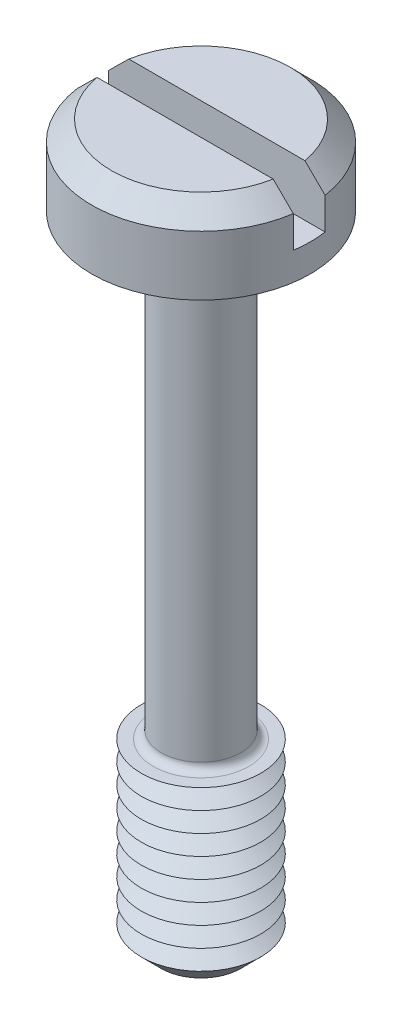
from build123d import *

# Parameters (mm, degrees)
SKETCH1_R           = 2.75
BOSS_EXTRUDE1_DEPTH = 2
SKETCH2_R           = 1
BOSS_EXTRUDE2_DEPTH = 16
SKETCH3_R           = 1.5
BOSS_EXTRUDE3_DEPTH = 4.5
CHAMFER1_SIZE       = 0.5
LPATTERN1_COUNT     = 8
LPATTERN1_PITCH     = 0.5
FILLET1_R           = 0.2
CHAMFER2_SIZE       = 0.5
SKETCH6_W           = 5.5
SKETCH6_H           = 0.8
CUT_EXTRUDE1_DEPTH  = 1.3


with BuildPart() as part:
    # Sketch1 → Boss-Extrude1 (new body)
    with BuildSketch(Plane(origin=(0, 0, 0), x_dir=(1, 0, 0), z_dir=(0, 1, 0))):
        with Locations(Location((0, 0, 0), (0, 0, 270))):
            Circle(SKETCH1_R)
    extrude(amount=BOSS_EXTRUDE1_DEPTH)

    # Sketch2 → Boss-Extrude2 (add)
    with BuildSketch(Plane.XZ):
        with Locations(Location((0, 0, 0), (0, 0, 270))):
            Circle(SKETCH2_R)
    extrude(amount=BOSS_EXTRUDE2_DEPTH)

    # Sketch3 → Boss-Extrude3 (add)
    with BuildSketch(Plane.XZ.offset(16)):
        with Locations(Location((0, 0, 0), (0, 0, 270))):
            Circle(SKETCH3_R)
    extrude(amount=-BOSS_EXTRUDE3_DEPTH)

    # Chamfer1
    chamfer1_edges = [part.edges().sort_by_distance(p)[0] for p in [
        (0, -16, 1.5),
    ]]
    chamfer(chamfer1_edges, length=CHAMFER1_SIZE)

    # Sketch5 → Cut-Revolve1 (revolve, cut)
    with BuildSketch(Plane(origin=(0, 0, 0), x_dir=(0, 0, -1), z_dir=(1, 0, 0))):
        Polygon((-1.5, -11.5), (-1.066987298, -11.75), (-1.5, -12), align=None)
    cut_revolve1 = revolve(axis=Axis((0, -6.58711856, 0), (0, -1, 0)), mode=Mode.SUBTRACT)

    # LPattern1: Cut-Revolve1 ×8
    with Locations(*[(0, -i * LPATTERN1_PITCH, 0) for i in range(1, LPATTERN1_COUNT)]):
        add(cut_revolve1, mode=Mode.SUBTRACT)

    # Fillet1
    fillet1_edges = [part.edges().sort_by_distance(p)[0] for p in [
        (0, 0, 1),
        (0, -11.5, 1),
    ]]
    fillet(fillet1_edges, radius=FILLET1_R)

    # Chamfer2
    chamfer2_edges = [part.edges().sort_by_distance(p)[0] for p in [
        (0, 2, -2.75),
    ]]
    chamfer(chamfer2_edges, length=CHAMFER2_SIZE)

    # Sketch6 → Cut-Extrude1 (cut)
    with BuildSketch(Plane(origin=(0, 2, 0), x_dir=(1, 0, 0), z_dir=(0, 1, 0))):
        Rectangle(SKETCH6_W, SKETCH6_H)
    extrude(amount=-CUT_EXTRUDE1_DEPTH, mode=Mode.SUBTRACT)


solid = part.part
